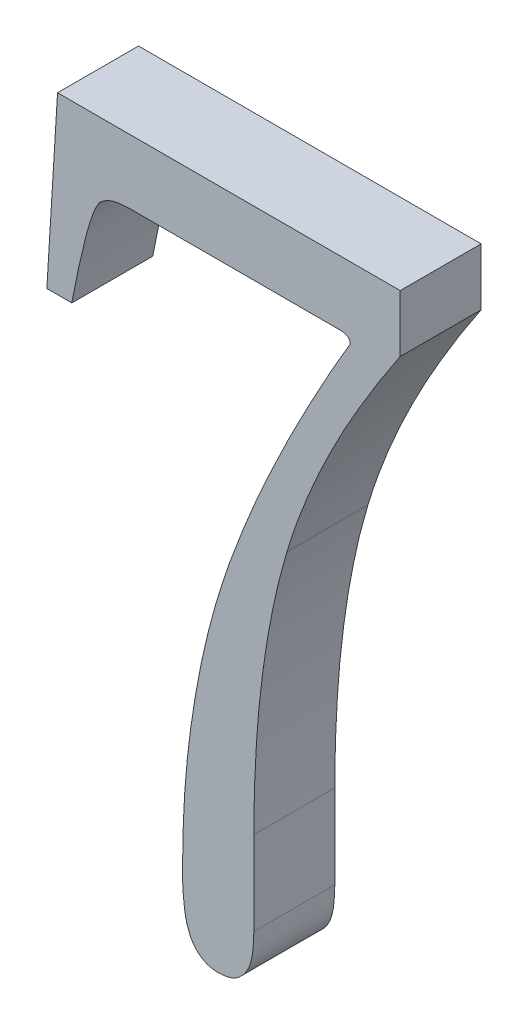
from build123d import *

# Parameters (mm, degrees)
EXTRUDE_1_DEPTH = 3


with BuildPart() as part:
    # Sketch 1 → Extrude 1 (new body)
    with BuildSketch(Plane.XY):
        with BuildLine():
            Line((2.645502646, 23.677248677), (15.343915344, 23.677248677))
            Line((15.343915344, 23.677248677), (15.343915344, 21.560846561))
            add(Edge.make_bspline(
                [(15.343915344, 21.560846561), (15.097836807, 21.191908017), (14.613798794, 20.466203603), (13.947936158, 19.367137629), (13.323906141, 18.295923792), (12.773952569, 17.237212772), (12.274220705, 16.20163811), (11.840844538, 15.183789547), (11.456956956, 14.187169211), (11.248145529, 13.52099526), (11.145404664, 13.193219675)],
                knots=[0, 0, 0, 0, 1.132496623, 2.22762791, 3.281410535, 4.298125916, 5.273779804, 6.217375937, 7.122900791, 8, 8, 8, 8], degree=3))
            add(Edge.make_bspline(
                [(11.145404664, 13.193219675), (11.045280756, 12.844720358), (10.842077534, 12.137434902), (10.603193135, 11.039921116), (10.389677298, 9.898477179), (10.22236636, 8.707993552), (10.081439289, 7.473416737), (9.993452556, 6.191782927), (9.930952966, 4.865405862), (9.924110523, 3.965066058), (9.920634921, 3.507740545)],
                knots=[0, 0, 0, 0, 0.888159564, 1.80253536, 2.750511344, 3.732788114, 4.747245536, 5.794270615, 6.879604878, 8, 8, 8, 8], degree=3))
            Line((9.920634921, 3.507740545), (9.920634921, 0.396825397))
            add(Edge.make_bspline(
                [(9.920634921, 0.396825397), (9.915621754, 0.223515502), (9.906406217, -0.095074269), (9.849619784, -0.531595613), (9.73727645, -0.885927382), (9.61417782, -1.071602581), (9.558103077, -1.156182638)],
                knots=[0, 0, 0, 0, 1.282452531, 2.357489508, 3.251792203, 4, 4, 4, 4], degree=3))
            add(Edge.make_bspline(
                [(9.558103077, -1.156182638), (9.498790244, -1.221267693), (9.380981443, -1.350541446), (9.152781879, -1.492403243), (8.885236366, -1.56964495), (8.696355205, -1.581250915), (8.597883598, -1.587301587)],
                knots=[0, 0, 0, 0, 0.966540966, 1.919770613, 2.91548988, 4, 4, 4, 4], degree=3))
            add(Edge.make_bspline(
                [(8.597883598, -1.587301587), (8.492081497, -1.580473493), (8.286336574, -1.56719544), (7.999994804, -1.441312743), (7.755076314, -1.236349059), (7.636418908, -1.055428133), (7.573976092, -0.960219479)],
                knots=[0, 0, 0, 0, 1.002648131, 1.949770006, 2.921077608, 4, 4, 4, 4], degree=3))
            add(Edge.make_bspline(
                [(7.573976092, -0.960219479), (7.526033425, -0.840535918), (7.419722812, -0.57514325), (7.338324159, -0.110616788), (7.284876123, 0.442814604), (7.278548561, 0.84244073), (7.275132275, 1.058201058)],
                knots=[0, 0, 0, 0, 0.751509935, 1.666437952, 2.740097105, 4, 4, 4, 4], degree=3))
            add(Edge.make_bspline(
                [(7.275132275, 1.058201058), (7.281600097, 1.538402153), (7.294434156, 2.4912621), (7.371945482, 3.905288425), (7.509129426, 5.293102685), (7.706344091, 6.650694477), (7.950608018, 7.983175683), (8.248495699, 9.28667036), (8.604397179, 10.562246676), (8.887911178, 11.393236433), (9.029002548, 11.806780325)],
                knots=[0, 0, 0, 0, 1.053126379, 2.089711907, 3.104609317, 4.110468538, 5.09738614, 6.074744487, 7.041892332, 8, 8, 8, 8], degree=3))
            add(Edge.make_bspline(
                [(9.029002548, 11.806780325), (9.166086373, 12.173238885), (9.444060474, 12.916331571), (9.898263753, 14.031894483), (10.401914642, 15.15993484), (10.939537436, 16.305595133), (11.518005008, 17.466885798), (12.137830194, 18.643208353), (12.789890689, 19.839079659), (13.256301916, 20.63129631), (13.492063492, 21.031746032)],
                knots=[0, 0, 0, 0, 0.915003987, 1.855415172, 2.816316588, 3.803808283, 4.814923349, 5.850151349, 6.913294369, 8, 8, 8, 8], degree=3))
            add(Edge.make_bspline(
                [(13.492063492, 21.031746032), (13.48826822, 21.072595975), (13.480963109, 21.151223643), (13.39210416, 21.246974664), (13.255632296, 21.291005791), (13.152665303, 21.294402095), (13.095238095, 21.296296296)],
                knots=[0, 0, 0, 0, 0.890073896, 1.713207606, 2.724600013, 4, 4, 4, 4], degree=3))
            Line((13.095238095, 21.296296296), (5.291005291, 21.296296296))
            add(Edge.make_bspline(
                [(5.291005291, 21.296296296), (5.178111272, 21.290942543), (4.963437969, 21.280762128), (4.660119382, 21.222656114), (4.402603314, 21.103191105), (4.265044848, 20.988997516), (4.19851068, 20.933764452)],
                knots=[0, 0, 0, 0, 1.149580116, 2.185980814, 3.122596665, 4, 4, 4, 4], degree=3))
            add(Edge.make_bspline(
                [(4.19851068, 20.933764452), (4.161198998, 20.874092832), (4.072666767, 20.732505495), (3.960337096, 20.466482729), (3.845792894, 20.119390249), (3.71634888, 19.694242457), (3.594692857, 19.183815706), (3.454851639, 18.595253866), (3.314105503, 17.92362549), (3.222831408, 17.447399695), (3.174603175, 17.195767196)],
                knots=[0, 0, 0, 0, 0.433555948, 1.028730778, 1.774044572, 2.688584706, 3.768290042, 5.009372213, 6.419784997, 8, 8, 8, 8], degree=3))
            Line((3.174603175, 17.195767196), (2.248677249, 17.195767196))
            Line((2.248677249, 17.195767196), (2.645502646, 23.677248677))
        make_face()
    extrude(amount=EXTRUDE_1_DEPTH)


solid = part.part
